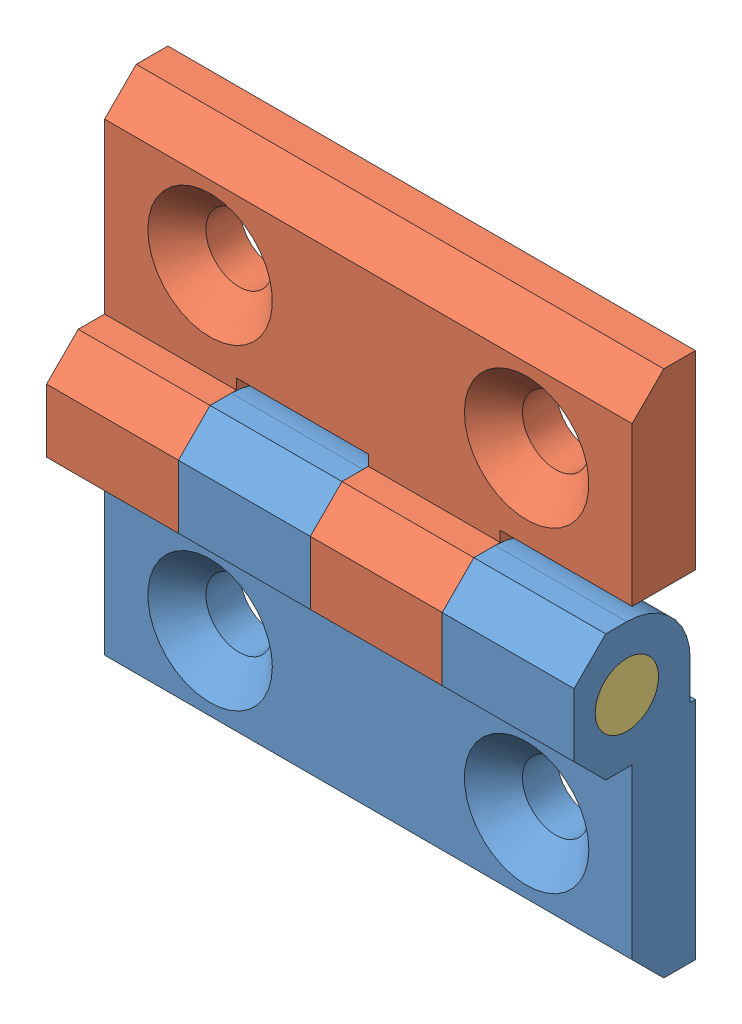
SolidWorks assembly FTH5050HC.sldasm, configuration Default (file format 15000). Lengths in mm.
Overall size (50 50 11.5).
3 component instances, 3 part files, 0 mates.
Components (placement in the parent):
- FTH5050HC_01-1: FTH5050HC_01.SLDPRT [Default] at origin size (50 31 11.5)
- FTH5050HC_02-1: FTH5050HC_02.SLDPRT [Default] at (30 30 0) x (-1 0 0) z (0 0 1) size (50 31 11.5)
- FTH5050HC_03-1: FTH5050HC_03.SLDPRT [Default] at (-10 15 6.5) x (0 0 -1) z (1 0 0) size (6 6 50)
